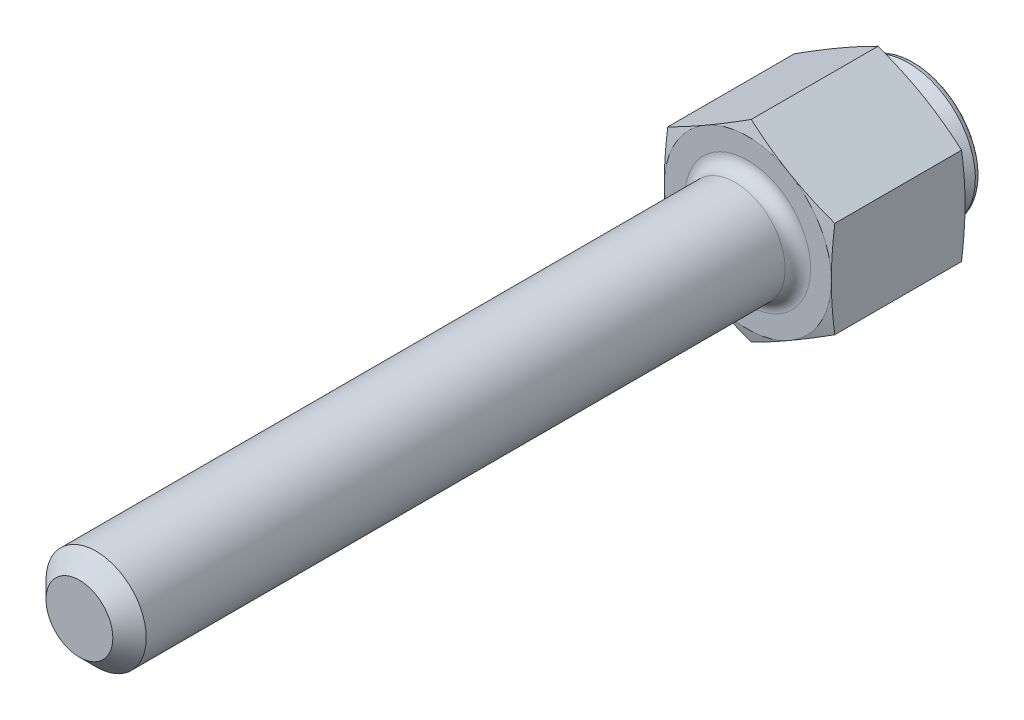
ISO-10303-21;
HEADER;
FILE_DESCRIPTION(('STEP AP214'),'2;1');
FILE_NAME('part.step','',(''),(''),'','','');
FILE_SCHEMA(('AUTOMOTIVE_DESIGN { 1 0 10303 214 1 1 1 1 }'));
ENDSEC;
DATA;
#1=APPLICATION_CONTEXT('core data for automotive mechanical design processes');
#2=APPLICATION_PROTOCOL_DEFINITION('international standard','automotive_design',2000,#1);
#3=PRODUCT_CONTEXT('',#1,'mechanical');
#4=PRODUCT('Part','Part','',(#3));
#5=PRODUCT_RELATED_PRODUCT_CATEGORY('part','',(#4));
#6=PRODUCT_DEFINITION_FORMATION('','',#4);
#7=PRODUCT_DEFINITION_CONTEXT('part definition',#1,'design');
#8=PRODUCT_DEFINITION('design','',#6,#7);
#9=PRODUCT_DEFINITION_SHAPE('','',#8);
#10=(LENGTH_UNIT() NAMED_UNIT(*) SI_UNIT(.MILLI.,.METRE.));
#11=(NAMED_UNIT(*) PLANE_ANGLE_UNIT() SI_UNIT($,.RADIAN.));
#12=(NAMED_UNIT(*) SI_UNIT($,.STERADIAN.) SOLID_ANGLE_UNIT());
#13=UNCERTAINTY_MEASURE_WITH_UNIT(LENGTH_MEASURE(1.E-05),#10,'distance_accuracy_value','');
#14=(GEOMETRIC_REPRESENTATION_CONTEXT(3) GLOBAL_UNCERTAINTY_ASSIGNED_CONTEXT((#13)) GLOBAL_UNIT_ASSIGNED_CONTEXT((#10,
#11,#12)) REPRESENTATION_CONTEXT('',''));
#15=CARTESIAN_POINT('',(0.,0.,0.));
#16=DIRECTION('',(0.,0.,1.));
#17=DIRECTION('',(1.,0.,0.));
#18=AXIS2_PLACEMENT_3D('',#15,#16,#17);
#19=CARTESIAN_POINT('',(0.,0.,4.0013999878));
#20=DIRECTION('',(0.,0.,-1.));
#21=DIRECTION('',(-0.268157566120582,0.963375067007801,0.));
#22=AXIS2_PLACEMENT_3D('',#19,#20,#21);
#23=SPHERICAL_SURFACE('',#22,3.5);
#24=CARTESIAN_POINT('',(0.,0.,2.6349999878));
#25=DIRECTION('',(0.,0.,-1.));
#26=DIRECTION('',(-0.963375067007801,-0.268157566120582,0.));
#27=AXIS2_PLACEMENT_3D('',#24,#25,#26);
#28=CIRCLE('',#27,3.2222586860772);
#29=CARTESIAN_POINT('',(-0.864073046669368,3.1042436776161,2.6349999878));
#30=VERTEX_POINT('',#29);
#31=EDGE_CURVE('E9',#30,#30,#28,.F.);
#32=CARTESIAN_POINT('',(0.,0.,2.25615730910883));
#33=DIRECTION('',(0.,0.,1.));
#34=DIRECTION('',(-0.268157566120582,0.963375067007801,0.));
#35=AXIS2_PLACEMENT_3D('',#32,#33,#34);
#36=CIRCLE('',#35,3.0338305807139);
#37=CARTESIAN_POINT('',(-0.813544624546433,2.92271673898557,2.25615730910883));
#38=VERTEX_POINT('',#37);
#39=EDGE_CURVE('E280',#38,#38,#36,.T.);
#40=CARTESIAN_POINT('',(-0.864073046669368,3.1042436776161,2.6349999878));
#41=CARTESIAN_POINT('',(-0.863611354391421,3.10258501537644,2.63093980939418));
#42=CARTESIAN_POINT('',(-0.863147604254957,3.10091896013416,2.62688288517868));
#43=CARTESIAN_POINT('',(-0.862215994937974,3.09757208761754,2.61877560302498));
#44=CARTESIAN_POINT('',(-0.861748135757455,3.09589127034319,2.61472524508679));
#45=CARTESIAN_POINT('',(-0.860808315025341,3.09251489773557,2.60663115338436));
#46=CARTESIAN_POINT('',(-0.860336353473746,3.0908193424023,2.60258741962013));
#47=CARTESIAN_POINT('',(-0.859388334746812,3.0874135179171,2.59450663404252));
#48=CARTESIAN_POINT('',(-0.858912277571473,3.08570324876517,2.59046958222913));
#49=CARTESIAN_POINT('',(-0.857956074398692,3.08226802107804,2.58240221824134));
#50=CARTESIAN_POINT('',(-0.85747592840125,3.08054306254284,2.57837190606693));
#51=CARTESIAN_POINT('',(-0.856511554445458,3.07707848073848,2.5703180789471));
#52=CARTESIAN_POINT('',(-0.856027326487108,3.07533885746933,2.56629456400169));
#53=CARTESIAN_POINT('',(-0.855054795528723,3.07184497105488,2.55825438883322));
#54=CARTESIAN_POINT('',(-0.854566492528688,3.07009070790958,2.55423772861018));
#55=CARTESIAN_POINT('',(-0.853585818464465,3.0665675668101,2.54621132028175));
#56=CARTESIAN_POINT('',(-0.853093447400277,3.06479868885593,2.54220157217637));
#57=CARTESIAN_POINT('',(-0.852104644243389,3.06124634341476,2.53418904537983));
#58=CARTESIAN_POINT('',(-0.851608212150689,3.05946287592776,2.53018626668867));
#59=CARTESIAN_POINT('',(-0.850611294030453,3.05588137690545,2.52218773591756));
#60=CARTESIAN_POINT('',(-0.850110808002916,3.05408334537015,2.5181919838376));
#61=CARTESIAN_POINT('',(-0.84910578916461,3.05047274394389,2.51020756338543));
#62=CARTESIAN_POINT('',(-0.84860125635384,3.04866017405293,2.50621889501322));
#63=CARTESIAN_POINT('',(-0.847588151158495,3.04502052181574,2.49824869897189));
#64=CARTESIAN_POINT('',(-0.847079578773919,3.0431934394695,2.49426717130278));
#65=CARTESIAN_POINT('',(-0.846058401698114,3.03952478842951,2.48631131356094));
#66=CARTESIAN_POINT('',(-0.845545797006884,3.03768321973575,2.48233698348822));
#67=CARTESIAN_POINT('',(-0.84451656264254,3.03398562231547,2.47439557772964));
#68=CARTESIAN_POINT('',(-0.843999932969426,3.03212959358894,2.47042850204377));
#69=CARTESIAN_POINT('',(-0.842962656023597,3.02840310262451,2.46250166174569));
#70=CARTESIAN_POINT('',(-0.842442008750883,3.0265326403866,2.45854189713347));
#71=CARTESIAN_POINT('',(-0.841396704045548,3.02277730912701,2.450629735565));
#72=CARTESIAN_POINT('',(-0.840872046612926,3.02089244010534,2.44667733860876));
#73=CARTESIAN_POINT('',(-0.839818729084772,3.01710832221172,2.43877996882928));
#74=CARTESIAN_POINT('',(-0.839290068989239,3.01520907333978,2.43483499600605));
#75=CARTESIAN_POINT('',(-0.838228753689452,3.01139622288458,2.42695253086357));
#76=CARTESIAN_POINT('',(-0.837696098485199,3.00948262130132,2.42301503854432));
#77=CARTESIAN_POINT('',(-0.836626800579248,3.00564109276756,2.41514759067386));
#78=CARTESIAN_POINT('',(-0.836090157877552,3.00371316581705,2.41121763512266));
#79=CARTESIAN_POINT('',(-0.835012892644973,2.99984301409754,2.40336531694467));
#80=CARTESIAN_POINT('',(-0.83447227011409,2.99790078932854,2.39944295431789));
#81=CARTESIAN_POINT('',(-0.833387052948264,2.9940020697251,2.39160587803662));
#82=CARTESIAN_POINT('',(-0.832842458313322,2.99204557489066,2.38769116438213));
#83=CARTESIAN_POINT('',(-0.83174930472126,2.98811834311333,2.37986944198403));
#84=CARTESIAN_POINT('',(-0.831200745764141,2.98614760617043,2.37596243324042));
#85=CARTESIAN_POINT('',(-0.830099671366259,2.98219191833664,2.36815617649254));
#86=CARTESIAN_POINT('',(-0.829547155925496,2.98020696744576,2.36425692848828));
#87=CARTESIAN_POINT('',(-0.828438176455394,2.97622288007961,2.3564662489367));
#88=CARTESIAN_POINT('',(-0.827881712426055,2.97422374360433,2.35257481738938));
#89=CARTESIAN_POINT('',(-0.826764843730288,2.97021131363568,2.34479982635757));
#90=CARTESIAN_POINT('',(-0.826204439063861,2.9681980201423,2.34091626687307));
#91=CARTESIAN_POINT('',(-0.825079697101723,2.96415730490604,2.33315707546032));
#92=CARTESIAN_POINT('',(-0.824515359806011,2.96212988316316,2.32928144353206));
#93=CARTESIAN_POINT('',(-0.823382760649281,2.9580609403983,2.32153816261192));
#94=CARTESIAN_POINT('',(-0.822814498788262,2.95601941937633,2.31767051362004));
#95=CARTESIAN_POINT('',(-0.82167405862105,2.95192230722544,2.30994325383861));
#96=CARTESIAN_POINT('',(-0.821101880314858,2.94986671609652,2.30608364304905));
#97=CARTESIAN_POINT('',(-0.819953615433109,2.94574149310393,2.29837251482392));
#98=CARTESIAN_POINT('',(-0.819377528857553,2.94367186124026,2.29452099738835));
#99=CARTESIAN_POINT('',(-0.818221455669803,2.9395185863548,2.28682611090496));
#100=CARTESIAN_POINT('',(-0.817641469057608,2.93743494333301,2.28298274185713));
#101=CARTESIAN_POINT('',(-0.81647760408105,2.93325367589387,2.27530420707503));
#102=CARTESIAN_POINT('',(-0.815893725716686,2.93115605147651,2.27146904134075));
#103=CARTESIAN_POINT('',(-0.814722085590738,2.92694685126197,2.26380696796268));
#104=CARTESIAN_POINT('',(-0.814134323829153,2.92483527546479,2.25998006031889));
#105=CARTESIAN_POINT('',(-0.813544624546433,2.92271673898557,2.25615730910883));
#106=B_SPLINE_CURVE_WITH_KNOTS('',3,(#40,#41,#42,#43,#44,#45,#46,#47,#48,#49,#50,#51,#52,#53,
#54,#55,#56,#57,#58,#59,#60,#61,#62,#63,#64,#65,#66,#67,#68,#69,#70,#71,#72,#73,#74,#75,#76,#77,
#78,#79,#80,#81,#82,#83,#84,#85,#86,#87,#88,#89,#90,#91,#92,#93,#94,#95,#96,#97,#98,#99,#100,
#101,#102,#103,#104,#105),.UNSPECIFIED.,.F.,.F.,(4,2,2,2,2,2,2,2,2,2,2,2,2,2,2,2,2,2,2,2,2,2,2,
2,2,2,2,2,2,2,2,2,4),(0.,0.0132304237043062,0.0264608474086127,0.0396912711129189,
0.0529216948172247,0.0661521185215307,0.0793825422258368,0.0926129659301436,0.10584338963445,
0.119073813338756,0.132304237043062,0.145534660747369,0.158765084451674,0.17199550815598,
0.185225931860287,0.198456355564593,0.211686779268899,0.224917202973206,0.238147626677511,
0.251378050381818,0.264608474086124,0.27783889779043,0.291069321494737,0.304299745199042,
0.317530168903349,0.330760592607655,0.343991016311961,0.357221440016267,0.370451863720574,
0.38368228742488,0.396912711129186,0.410143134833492,0.423373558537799),.UNSPECIFIED.);
#107=EDGE_CURVE('BSEAM14',#30,#38,#106,.T.);
#108=ORIENTED_EDGE('',*,*,#31,.F.);
#109=ORIENTED_EDGE('',*,*,#39,.T.);
#110=ORIENTED_EDGE('',*,*,#107,.T.);
#111=ORIENTED_EDGE('',*,*,#107,.F.);
#112=EDGE_LOOP('',(#108,#110,#109,#111));
#113=FACE_BOUND('',#112,.T.);
#114=ADVANCED_FACE('F14',(#113),#23,.T.);
#115=CARTESIAN_POINT('',(0.,0.,0.));
#116=DIRECTION('',(0.,0.,-1.));
#117=DIRECTION('',(0.268157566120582,-0.963375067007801,0.));
#118=AXIS2_PLACEMENT_3D('',#115,#116,#117);
#119=CYLINDRICAL_SURFACE('',#118,3.);
#120=CARTESIAN_POINT('',(0.,0.,2.12950255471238));
#121=DIRECTION('',(0.,0.,1.));
#122=DIRECTION('',(-0.268157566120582,0.963375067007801,0.));
#123=AXIS2_PLACEMENT_3D('',#120,#121,#122);
#124=CIRCLE('',#123,3.);
#125=CARTESIAN_POINT('',(-0.804472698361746,2.8901252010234,2.12950255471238));
#126=VERTEX_POINT('',#125);
#127=EDGE_CURVE('E278',#126,#126,#124,.F.);
#128=ORIENTED_EDGE('',*,*,#127,.T.);
#129=EDGE_LOOP('',(#128));
#130=FACE_BOUND('',#129,.T.);
#131=CARTESIAN_POINT('',(0.,0.,1.48621024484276));
#132=DIRECTION('',(0.,0.,-1.));
#133=DIRECTION('',(0.268157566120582,-0.963375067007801,0.));
#134=AXIS2_PLACEMENT_3D('',#131,#132,#133);
#135=CIRCLE('',#134,3.);
#136=CARTESIAN_POINT('',(0.804472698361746,-2.8901252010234,1.48621024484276));
#137=VERTEX_POINT('',#136);
#138=EDGE_CURVE('E275',#137,#137,#135,.F.);
#139=ORIENTED_EDGE('',*,*,#138,.T.);
#140=EDGE_LOOP('',(#139));
#141=FACE_BOUND('',#140,.T.);
#142=ADVANCED_FACE('F299',(#130,#141),#119,.T.);
#143=CARTESIAN_POINT('',(0.,0.,1.381));
#144=DIRECTION('',(0.,0.,-1.));
#145=DIRECTION('',(0.268157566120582,-0.963375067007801,0.));
#146=AXIS2_PLACEMENT_3D('',#143,#144,#145);
#147=CONICAL_SURFACE('',#146,3.,0.78539816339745);
#148=CARTESIAN_POINT('',(0.,0.,1.30660512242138));
#149=DIRECTION('',(0.,0.,-1.));
#150=DIRECTION('',(0.268157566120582,-0.963375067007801,0.));
#151=AXIS2_PLACEMENT_3D('',#148,#149,#150);
#152=CIRCLE('',#151,3.07439487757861);
#153=CARTESIAN_POINT('',(0.824422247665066,-2.96179537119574,1.30660512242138));
#154=VERTEX_POINT('',#153);
#155=EDGE_CURVE('E18',#154,#154,#152,.T.);
#156=ORIENTED_EDGE('',*,*,#155,.T.);
#157=EDGE_LOOP('',(#156));
#158=FACE_BOUND('',#157,.T.);
#159=CARTESIAN_POINT('',(0.,0.,0.381));
#160=DIRECTION('',(0.,0.,-1.));
#161=DIRECTION('',(0.268157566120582,-0.963375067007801,0.));
#162=AXIS2_PLACEMENT_3D('',#159,#160,#161);
#163=CIRCLE('',#162,4.);
#164=CARTESIAN_POINT('',(1.07263026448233,-3.8535002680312,0.381));
#165=VERTEX_POINT('',#164);
#166=EDGE_CURVE('E269',#165,#165,#163,.T.);
#167=ORIENTED_EDGE('',*,*,#166,.F.);
#168=EDGE_LOOP('',(#167));
#169=FACE_BOUND('',#168,.T.);
#170=ADVANCED_FACE('F305',(#158,#169),#147,.T.);
#171=CARTESIAN_POINT('',(-1.07263026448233,3.85350026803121,0.));
#172=DIRECTION('',(0.,0.,1.));
#173=DIRECTION('',(-0.268157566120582,0.963375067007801,0.));
#174=AXIS2_PLACEMENT_3D('',#171,#172,#173);
#175=PLANE('',#174);
#176=CARTESIAN_POINT('',(0.,0.,0.));
#177=DIRECTION('',(0.,0.,1.));
#178=DIRECTION('',(-0.268157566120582,0.963375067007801,0.));
#179=AXIS2_PLACEMENT_3D('',#176,#177,#178);
#180=CIRCLE('',#179,3.619);
#181=CARTESIAN_POINT('',(-0.970462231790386,3.48645436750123,0.));
#182=VERTEX_POINT('',#181);
#183=EDGE_CURVE('E272',#182,#182,#180,.F.);
#184=ORIENTED_EDGE('',*,*,#183,.T.);
#185=EDGE_LOOP('',(#184));
#186=FACE_BOUND('',#185,.T.);
#187=ADVANCED_FACE('F347',(#186),#175,.F.);
#188=CARTESIAN_POINT('',(0.,0.,0.381));
#189=DIRECTION('',(0.,0.,1.));
#190=DIRECTION('',(-0.268157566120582,0.963375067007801,0.));
#191=AXIS2_PLACEMENT_3D('',#188,#189,#190);
#192=TOROIDAL_SURFACE('',#191,3.619,0.381);
#193=ORIENTED_EDGE('',*,*,#166,.T.);
#194=EDGE_LOOP('',(#193));
#195=FACE_BOUND('',#194,.T.);
#196=ORIENTED_EDGE('',*,*,#183,.F.);
#197=EDGE_LOOP('',(#196));
#198=FACE_BOUND('',#197,.T.);
#199=ADVANCED_FACE('F350',(#195,#198),#192,.T.);
#200=CARTESIAN_POINT('',(0.,0.,2.12950255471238));
#201=DIRECTION('',(0.,0.,1.));
#202=DIRECTION('',(-0.268157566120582,0.963375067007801,0.));
#203=AXIS2_PLACEMENT_3D('',#200,#201,#202);
#204=TOROIDAL_SURFACE('',#203,3.254,0.254);
#205=ORIENTED_EDGE('',*,*,#39,.F.);
#206=EDGE_LOOP('',(#205));
#207=FACE_BOUND('',#206,.T.);
#208=ORIENTED_EDGE('',*,*,#127,.F.);
#209=EDGE_LOOP('',(#208));
#210=FACE_BOUND('',#209,.T.);
#211=ADVANCED_FACE('F321',(#207,#210),#204,.F.);
#212=CARTESIAN_POINT('',(0.,0.,1.48621024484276));
#213=DIRECTION('',(0.,0.,-1.));
#214=DIRECTION('',(0.268157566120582,-0.963375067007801,0.));
#215=AXIS2_PLACEMENT_3D('',#212,#213,#214);
#216=TOROIDAL_SURFACE('',#215,3.254,0.254);
#217=ORIENTED_EDGE('',*,*,#138,.F.);
#218=EDGE_LOOP('',(#217));
#219=FACE_BOUND('',#218,.T.);
#220=ORIENTED_EDGE('',*,*,#155,.F.);
#221=EDGE_LOOP('',(#220));
#222=FACE_BOUND('',#221,.T.);
#223=ADVANCED_FACE('F16',(#219,#222),#216,.F.);
#224=CARTESIAN_POINT('',(0.,0.,49.9999999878));
#225=DIRECTION('',(0.,0.,1.));
#226=DIRECTION('',(1.,0.,0.));
#227=AXIS2_PLACEMENT_3D('',#224,#225,#226);
#228=PLANE('',#227);
#229=CARTESIAN_POINT('',(0.,0.,49.9999999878));
#230=DIRECTION('',(0.,0.,1.));
#231=DIRECTION('',(1.,0.,0.));
#232=AXIS2_PLACEMENT_3D('',#229,#230,#231);
#233=CIRCLE('',#232,2.);
#234=CARTESIAN_POINT('',(2.,0.,49.9999999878));
#235=VERTEX_POINT('',#234);
#236=EDGE_CURVE('E264',#235,#235,#233,.T.);
#237=ORIENTED_EDGE('',*,*,#236,.T.);
#238=EDGE_LOOP('',(#237));
#239=FACE_BOUND('',#238,.T.);
#240=ADVANCED_FACE('F309',(#239),#228,.T.);
#241=CARTESIAN_POINT('',(0.,0.,49.9999999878));
#242=DIRECTION('',(0.,0.,-1.));
#243=DIRECTION('',(-1.,0.,0.));
#244=AXIS2_PLACEMENT_3D('',#241,#242,#243);
#245=CONICAL_SURFACE('',#244,2.,0.785398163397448);
#246=CARTESIAN_POINT('',(0.,0.,48.9999999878));
#247=DIRECTION('',(0.,0.,1.));
#248=DIRECTION('',(1.,0.,0.));
#249=AXIS2_PLACEMENT_3D('',#246,#247,#248);
#250=CIRCLE('',#249,3.);
#251=CARTESIAN_POINT('',(3.,0.,48.9999999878));
#252=VERTEX_POINT('',#251);
#253=EDGE_CURVE('E23',#252,#252,#250,.F.);
#254=ORIENTED_EDGE('',*,*,#253,.F.);
#255=EDGE_LOOP('',(#254));
#256=FACE_BOUND('',#255,.T.);
#257=ORIENTED_EDGE('',*,*,#236,.F.);
#258=EDGE_LOOP('',(#257));
#259=FACE_BOUND('',#258,.T.);
#260=ADVANCED_FACE('F311',(#256,#259),#245,.T.);
#261=CARTESIAN_POINT('',(0.,0.,49.9999999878));
#262=DIRECTION('',(0.,0.,-1.));
#263=DIRECTION('',(-1.,0.,0.));
#264=AXIS2_PLACEMENT_3D('',#261,#262,#263);
#265=CYLINDRICAL_SURFACE('',#264,3.);
#266=ORIENTED_EDGE('',*,*,#253,.T.);
#267=EDGE_LOOP('',(#266));
#268=FACE_BOUND('',#267,.T.);
#269=CARTESIAN_POINT('',(0.,0.,10.7619999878));
#270=DIRECTION('',(0.,0.,-1.));
#271=DIRECTION('',(-1.,0.,0.));
#272=AXIS2_PLACEMENT_3D('',#269,#270,#271);
#273=CIRCLE('',#272,3.);
#274=CARTESIAN_POINT('',(-3.,0.,10.7619999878));
#275=VERTEX_POINT('',#274);
#276=EDGE_CURVE('E258',#275,#275,#273,.F.);
#277=ORIENTED_EDGE('',*,*,#276,.T.);
#278=EDGE_LOOP('',(#277));
#279=FACE_BOUND('',#278,.T.);
#280=ADVANCED_FACE('F318',(#268,#279),#265,.T.);
#281=CARTESIAN_POINT('',(0.,0.,10.7619999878));
#282=DIRECTION('',(0.,0.,-1.));
#283=DIRECTION('',(-1.,0.,0.));
#284=AXIS2_PLACEMENT_3D('',#281,#282,#283);
#285=TOROIDAL_SURFACE('',#284,3.762,0.762);
#286=CARTESIAN_POINT('',(0.,0.,9.9999999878));
#287=DIRECTION('',(0.,0.,-1.));
#288=DIRECTION('',(-1.,0.,0.));
#289=AXIS2_PLACEMENT_3D('',#286,#287,#288);
#290=CIRCLE('',#289,3.762);
#291=CARTESIAN_POINT('',(-3.762,0.,9.9999999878));
#292=VERTEX_POINT('',#291);
#293=EDGE_CURVE('E261',#292,#292,#290,.T.);
#294=ORIENTED_EDGE('',*,*,#293,.F.);
#295=EDGE_LOOP('',(#294));
#296=FACE_BOUND('',#295,.T.);
#297=ORIENTED_EDGE('',*,*,#276,.F.);
#298=EDGE_LOOP('',(#297));
#299=FACE_BOUND('',#298,.T.);
#300=ADVANCED_FACE('F324',(#296,#299),#285,.F.);
#301=CARTESIAN_POINT('',(-5.,8.66025403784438,9.9999999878));
#302=DIRECTION('',(0.,0.,-1.));
#303=DIRECTION('',(-1.,0.,0.));
#304=AXIS2_PLACEMENT_3D('',#301,#302,#303);
#305=PLANE('',#304);
#306=CARTESIAN_POINT('',(0.,0.,9.9999999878));
#307=DIRECTION('',(0.,0.,-1.));
#308=DIRECTION('',(-1.,0.,0.));
#309=AXIS2_PLACEMENT_3D('',#306,#307,#308);
#310=CIRCLE('',#309,5.);
#311=CARTESIAN_POINT('',(-5.,0.,9.9999999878));
#312=VERTEX_POINT('',#311);
#313=CARTESIAN_POINT('',(-2.5,4.33012701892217,9.9999999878));
#314=VERTEX_POINT('',#313);
#315=EDGE_CURVE('E624',#312,#314,#310,.T.);
#316=ORIENTED_EDGE('',*,*,#315,.F.);
#317=CARTESIAN_POINT('',(0.,0.,9.9999999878));
#318=DIRECTION('',(0.,0.,-1.));
#319=DIRECTION('',(-1.,0.,0.));
#320=AXIS2_PLACEMENT_3D('',#317,#318,#319);
#321=CIRCLE('',#320,5.);
#322=CARTESIAN_POINT('',(-2.5,-4.33012701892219,9.9999999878));
#323=VERTEX_POINT('',#322);
#324=EDGE_CURVE('E235',#323,#312,#321,.T.);
#325=ORIENTED_EDGE('',*,*,#324,.F.);
#326=CARTESIAN_POINT('',(2.5,-4.33012701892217,9.9999999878));
#327=VERTEX_POINT('',#326);
#328=EDGE_CURVE('E249',#327,#323,#321,.T.);
#329=ORIENTED_EDGE('',*,*,#328,.F.);
#330=CARTESIAN_POINT('',(5.,0.,9.9999999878));
#331=VERTEX_POINT('',#330);
#332=EDGE_CURVE('E670',#331,#327,#321,.T.);
#333=ORIENTED_EDGE('',*,*,#332,.F.);
#334=CARTESIAN_POINT('',(2.5,4.33012701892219,9.9999999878));
#335=VERTEX_POINT('',#334);
#336=EDGE_CURVE('E672',#335,#331,#321,.T.);
#337=ORIENTED_EDGE('',*,*,#336,.F.);
#338=EDGE_CURVE('E250',#314,#335,#321,.T.);
#339=ORIENTED_EDGE('',*,*,#338,.F.);
#340=EDGE_LOOP('',(#316,#325,#329,#333,#337,#339));
#341=FACE_BOUND('',#340,.T.);
#342=ORIENTED_EDGE('',*,*,#293,.T.);
#343=EDGE_LOOP('',(#342));
#344=FACE_BOUND('',#343,.T.);
#345=ADVANCED_FACE('F329',(#341,#344),#305,.F.);
#346=CARTESIAN_POINT('',(0.,0.,8.58583630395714));
#347=DIRECTION('',(0.,0.,-1.));
#348=DIRECTION('',(-1.,0.,0.));
#349=AXIS2_PLACEMENT_3D('',#346,#347,#348);
#350=CONICAL_SURFACE('',#349,10.2777307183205,1.30899693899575);
#351=CARTESIAN_POINT('',(5.,-7.71939307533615,8.87535574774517));
#352=CARTESIAN_POINT('',(5.00000000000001,-7.49157817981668,8.92657651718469));
#353=CARTESIAN_POINT('',(5.00000000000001,-7.26362305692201,8.97718453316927));
#354=CARTESIAN_POINT('',(5.00000000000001,-6.80736329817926,9.07684412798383));
#355=CARTESIAN_POINT('',(5.00000000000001,-6.57905864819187,9.1258956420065));
#356=CARTESIAN_POINT('',(5.00000000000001,-6.12183892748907,9.222151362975));
#357=CARTESIAN_POINT('',(5.00000000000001,-5.89292348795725,9.26935382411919));
#358=CARTESIAN_POINT('',(5.00000000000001,-5.43462208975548,9.36141523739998));
#359=CARTESIAN_POINT('',(5.00000000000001,-5.20523613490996,9.40627420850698));
#360=CARTESIAN_POINT('',(5.00000000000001,-4.74777405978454,9.49273650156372));
#361=CARTESIAN_POINT('',(5.00000000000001,-4.51970239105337,9.53436326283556));
#362=CARTESIAN_POINT('',(5.00000000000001,-4.06294165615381,9.61407288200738));
#363=CARTESIAN_POINT('',(5.00000000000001,-3.83425260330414,9.65215581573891));
#364=CARTESIAN_POINT('',(5.00000000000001,-3.37620199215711,9.72393812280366));
#365=CARTESIAN_POINT('',(5.00000000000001,-3.14684049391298,9.75763787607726));
#366=CARTESIAN_POINT('',(5.00000000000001,-2.68738519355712,9.81967591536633));
#367=CARTESIAN_POINT('',(5.,-2.4572913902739,9.84801419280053));
#368=CARTESIAN_POINT('',(5.,-1.99373595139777,9.89854595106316));
#369=CARTESIAN_POINT('',(5.,-1.76026606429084,9.92066484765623));
#370=CARTESIAN_POINT('',(5.00000000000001,-1.29272172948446,9.95724257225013));
#371=CARTESIAN_POINT('',(5.00000000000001,-1.05864729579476,9.9717015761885));
#372=CARTESIAN_POINT('',(5.,-0.590237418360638,9.99211738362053));
#373=CARTESIAN_POINT('',(5.,-0.355902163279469,9.99807842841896));
#374=CARTESIAN_POINT('',(5.,0.112826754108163,10.0011300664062));
#375=CARTESIAN_POINT('',(5.,0.347220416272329,9.99822068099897));
#376=CARTESIAN_POINT('',(5.,0.816634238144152,9.98369271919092));
#377=CARTESIAN_POINT('',(5.,1.05165334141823,9.97204069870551));
#378=CARTESIAN_POINT('',(5.,1.52115001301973,9.94069812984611));
#379=CARTESIAN_POINT('',(5.,1.7556275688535,9.92100739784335));
#380=CARTESIAN_POINT('',(5.,2.22403930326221,9.87460237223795));
#381=CARTESIAN_POINT('',(5.,2.45797299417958,9.84788323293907));
#382=CARTESIAN_POINT('',(5.,2.92508386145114,9.78855862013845));
#383=CARTESIAN_POINT('',(5.,3.15826103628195,9.75595313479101));
#384=CARTESIAN_POINT('',(5.,3.6242567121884,9.68586811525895));
#385=CARTESIAN_POINT('',(5.,3.85707404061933,9.64838085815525));
#386=CARTESIAN_POINT('',(5.,4.32204975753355,9.56950129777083));
#387=CARTESIAN_POINT('',(5.,4.55420812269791,9.5281088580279));
#388=CARTESIAN_POINT('',(5.,5.01796734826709,9.44218275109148));
#389=CARTESIAN_POINT('',(5.,5.24956814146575,9.39764872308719));
#390=CARTESIAN_POINT('',(5.,5.71227051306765,9.30605222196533));
#391=CARTESIAN_POINT('',(5.,5.94337208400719,9.2589897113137));
#392=CARTESIAN_POINT('',(4.99999999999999,6.63618971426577,9.11473521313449));
#393=CARTESIAN_POINT('',(4.99999999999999,7.09727206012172,9.01450411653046));
#394=CARTESIAN_POINT('',(4.99999999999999,8.01819214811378,8.80869227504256));
#395=CARTESIAN_POINT('',(4.99999999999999,8.47802997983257,8.703111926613));
#396=CARTESIAN_POINT('',(4.99999999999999,9.39186405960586,8.48941702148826));
#397=CARTESIAN_POINT('',(4.99999999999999,9.84586964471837,8.38134228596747));
#398=CARTESIAN_POINT('',(4.99999999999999,10.7532680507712,8.16261349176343));
#399=CARTESIAN_POINT('',(4.99999999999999,11.2066608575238,8.05195937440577));
#400=CARTESIAN_POINT('',(4.99999999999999,12.112331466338,7.82893014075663));
#401=CARTESIAN_POINT('',(4.99999999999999,12.5646099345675,7.71655772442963));
#402=CARTESIAN_POINT('',(4.99999999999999,13.4687908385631,7.49037953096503));
#403=CARTESIAN_POINT('',(4.99999999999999,13.9206932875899,7.37657380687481));
#404=CARTESIAN_POINT('',(5.,14.3724678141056,7.26226851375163));
#405=B_SPLINE_CURVE_WITH_KNOTS('',3,(#351,#352,#353,#354,#355,#356,#357,#358,#359,#360,#361,
#362,#363,#364,#365,#366,#367,#368,#369,#370,#371,#372,#373,#374,#375,#376,#377,#378,#379,#380,
#381,#382,#383,#384,#385,#386,#387,#388,#389,#390,#391,#392,#393,#394,#395,#396,#397,#398,#399,
#400,#401,#402,#403,#404),.UNSPECIFIED.,.F.,.F.,(4,2,2,2,2,2,2,2,2,2,2,2,2,2,2,2,2,2,2,2,2,2,2,
2,2,2,4),(0.,0.700508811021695,1.40104675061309,2.10223090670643,2.80340938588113,
3.49890505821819,4.19438584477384,4.88980630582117,5.58522787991,6.28866433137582,
6.99208462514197,7.69515372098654,8.39822112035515,9.10399183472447,9.8097786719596,
10.5160533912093,11.2223295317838,11.9297368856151,12.6371689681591,13.3446824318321,
14.0522064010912,15.4677020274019,16.883092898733,18.283157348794,19.6832536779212,
21.0813391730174,22.4793730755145),.UNSPECIFIED.);
#406=CARTESIAN_POINT('',(5.,-2.88675134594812,9.79274056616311));
#407=VERTEX_POINT('',#406);
#408=EDGE_CURVE('E231',#331,#407,#405,.F.);
#409=ORIENTED_EDGE('',*,*,#408,.F.);
#410=ORIENTED_EDGE('',*,*,#332,.T.);
#411=CARTESIAN_POINT('',(5.0002,-2.88663587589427,9.79270962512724));
#412=CARTESIAN_POINT('',(4.79254599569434,-3.00652497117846,9.824847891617));
#413=CARTESIAN_POINT('',(4.58451548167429,-3.12663144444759,9.85402417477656));
#414=CARTESIAN_POINT('',(4.16771975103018,-3.36726857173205,9.90528421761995));
#415=CARTESIAN_POINT('',(3.95895427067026,-3.48779937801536,9.92736509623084));
#416=CARTESIAN_POINT('',(3.54195440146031,-3.72855436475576,9.96314521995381));
#417=CARTESIAN_POINT('',(3.33372283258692,-3.84877691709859,9.97688713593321));
#418=CARTESIAN_POINT('',(2.91699413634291,-4.08937534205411,9.99531364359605));
#419=CARTESIAN_POINT('',(2.70849706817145,-4.20975118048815,9.9999999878));
#420=CARTESIAN_POINT('',(2.29150293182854,-4.45050285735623,9.9999999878));
#421=CARTESIAN_POINT('',(2.08300586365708,-4.57087869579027,9.99531364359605));
#422=CARTESIAN_POINT('',(1.66627716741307,-4.81147712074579,9.97688713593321));
#423=CARTESIAN_POINT('',(1.45804559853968,-4.93169967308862,9.9631452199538));
#424=CARTESIAN_POINT('',(1.04104572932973,-5.17245465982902,9.92736509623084));
#425=CARTESIAN_POINT('',(0.832280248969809,-5.29298546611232,9.90528421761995));
#426=CARTESIAN_POINT('',(0.415484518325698,-5.53362259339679,9.85402417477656));
#427=CARTESIAN_POINT('',(0.207454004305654,-5.65372906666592,9.824847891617));
#428=CARTESIAN_POINT('',(-0.000200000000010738,-5.7736181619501,9.79270962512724));
#429=B_SPLINE_CURVE_WITH_KNOTS('',3,(#411,#412,#413,#414,#415,#416,#417,#418,#419,#420,#421,
#422,#423,#424,#425,#426,#427,#428),.UNSPECIFIED.,.F.,.F.,(4,2,2,2,2,2,2,2,4),(0.,
0.72580523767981,1.45190481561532,2.17425686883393,2.89646911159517,3.61868135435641,
4.34103340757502,5.06713298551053,5.79293822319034),.UNSPECIFIED.);
#430=EDGE_CURVE('E230',#407,#327,#429,.T.);
#431=ORIENTED_EDGE('',*,*,#430,.F.);
#432=EDGE_LOOP('',(#409,#410,#431));
#433=FACE_BOUND('',#432,.T.);
#434=ADVANCED_FACE('F341',(#433),#350,.T.);
#435=CARTESIAN_POINT('',(-0.000200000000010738,5.7736181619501,9.79270962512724));
#436=CARTESIAN_POINT('',(0.207454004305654,5.65372906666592,9.824847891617));
#437=CARTESIAN_POINT('',(0.415484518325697,5.53362259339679,9.85402417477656));
#438=CARTESIAN_POINT('',(0.832280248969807,5.29298546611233,9.90528421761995));
#439=CARTESIAN_POINT('',(1.04104572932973,5.17245465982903,9.92736509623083));
#440=CARTESIAN_POINT('',(1.45804559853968,4.93169967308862,9.9631452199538));
#441=CARTESIAN_POINT('',(1.66627716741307,4.81147712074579,9.97688713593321));
#442=CARTESIAN_POINT('',(2.08300586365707,4.57087869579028,9.99531364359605));
#443=CARTESIAN_POINT('',(2.29150293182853,4.45050285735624,9.9999999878));
#444=CARTESIAN_POINT('',(2.70849706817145,4.20975118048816,9.9999999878));
#445=CARTESIAN_POINT('',(2.9169941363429,4.08937534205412,9.99531364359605));
#446=CARTESIAN_POINT('',(3.33372283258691,3.8487769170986,9.97688713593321));
#447=CARTESIAN_POINT('',(3.5419544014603,3.72855436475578,9.9631452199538));
#448=CARTESIAN_POINT('',(3.95895427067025,3.48779937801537,9.92736509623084));
#449=CARTESIAN_POINT('',(4.16771975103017,3.36726857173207,9.90528421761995));
#450=CARTESIAN_POINT('',(4.58451548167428,3.12663144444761,9.85402417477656));
#451=CARTESIAN_POINT('',(4.79254599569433,3.00652497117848,9.824847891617));
#452=CARTESIAN_POINT('',(5.0002,2.88663587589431,9.79270962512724));
#453=B_SPLINE_CURVE_WITH_KNOTS('',3,(#435,#436,#437,#438,#439,#440,#441,#442,#443,#444,#445,
#446,#447,#448,#449,#450,#451,#452),.UNSPECIFIED.,.F.,.F.,(4,2,2,2,2,2,2,2,4),(0.,
0.725805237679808,1.45190481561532,2.17425686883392,2.89646911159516,3.6186813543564,
4.341033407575,5.06713298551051,5.79293822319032),.UNSPECIFIED.);
#454=CARTESIAN_POINT('',(5.,2.88675134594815,9.7927405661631));
#455=VERTEX_POINT('',#454);
#456=EDGE_CURVE('E643',#335,#455,#453,.T.);
#457=ORIENTED_EDGE('',*,*,#456,.F.);
#458=ORIENTED_EDGE('',*,*,#336,.T.);
#459=EDGE_CURVE('E217',#455,#331,#405,.F.);
#460=ORIENTED_EDGE('',*,*,#459,.F.);
#461=EDGE_LOOP('',(#457,#458,#460));
#462=FACE_BOUND('',#461,.T.);
#463=ADVANCED_FACE('F418',(#462),#350,.T.);
#464=CARTESIAN_POINT('',(-5.0002,2.88663587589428,9.79270962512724));
#465=CARTESIAN_POINT('',(-4.79254599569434,3.00652497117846,9.824847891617));
#466=CARTESIAN_POINT('',(-4.58451548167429,3.12663144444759,9.85402417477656));
#467=CARTESIAN_POINT('',(-4.16771975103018,3.36726857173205,9.90528421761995));
#468=CARTESIAN_POINT('',(-3.95895427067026,3.48779937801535,9.92736509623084));
#469=CARTESIAN_POINT('',(-3.54195440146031,3.72855436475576,9.9631452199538));
#470=CARTESIAN_POINT('',(-3.33372283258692,3.84877691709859,9.97688713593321));
#471=CARTESIAN_POINT('',(-2.91699413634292,4.08937534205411,9.99531364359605));
#472=CARTESIAN_POINT('',(-2.70849706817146,4.20975118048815,9.9999999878));
#473=CARTESIAN_POINT('',(-2.29150293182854,4.45050285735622,9.9999999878));
#474=CARTESIAN_POINT('',(-2.08300586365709,4.57087869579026,9.99531364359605));
#475=CARTESIAN_POINT('',(-1.66627716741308,4.81147712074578,9.97688713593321));
#476=CARTESIAN_POINT('',(-1.45804559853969,4.93169967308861,9.96314521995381));
#477=CARTESIAN_POINT('',(-1.04104572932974,5.17245465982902,9.92736509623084));
#478=CARTESIAN_POINT('',(-0.83228024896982,5.29298546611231,9.90528421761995));
#479=CARTESIAN_POINT('',(-0.415484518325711,5.53362259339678,9.85402417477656));
#480=CARTESIAN_POINT('',(-0.207454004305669,5.65372906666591,9.824847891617));
#481=CARTESIAN_POINT('',(0.00019999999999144,5.7736181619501,9.79270962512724));
#482=B_SPLINE_CURVE_WITH_KNOTS('',3,(#464,#465,#466,#467,#468,#469,#470,#471,#472,#473,#474,
#475,#476,#477,#478,#479,#480,#481),.UNSPECIFIED.,.F.,.F.,(4,2,2,2,2,2,2,2,4),(0.,
0.725805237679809,1.45190481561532,2.17425686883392,2.89646911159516,3.6186813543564,
4.341033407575,5.06713298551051,5.79293822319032),.UNSPECIFIED.);
#483=CARTESIAN_POINT('',(0.,5.77350269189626,9.7927405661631));
#484=VERTEX_POINT('',#483);
#485=EDGE_CURVE('E626',#314,#484,#482,.T.);
#486=ORIENTED_EDGE('',*,*,#485,.F.);
#487=ORIENTED_EDGE('',*,*,#338,.T.);
#488=EDGE_CURVE('E636',#484,#335,#453,.T.);
#489=ORIENTED_EDGE('',*,*,#488,.F.);
#490=EDGE_LOOP('',(#486,#487,#489));
#491=FACE_BOUND('',#490,.T.);
#492=ADVANCED_FACE('F159',(#491),#350,.T.);
#493=ORIENTED_EDGE('',*,*,#315,.T.);
#494=CARTESIAN_POINT('',(-5.,2.88675134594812,9.7927405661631));
#495=VERTEX_POINT('',#494);
#496=EDGE_CURVE('E629',#495,#314,#482,.T.);
#497=ORIENTED_EDGE('',*,*,#496,.F.);
#498=CARTESIAN_POINT('',(-5.,-7.71939307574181,8.87535574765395));
#499=CARTESIAN_POINT('',(-5.,-7.49157818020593,8.92657651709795));
#500=CARTESIAN_POINT('',(-4.99999999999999,-7.26362305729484,8.97718453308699));
#501=CARTESIAN_POINT('',(-4.99999999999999,-6.80736329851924,9.07684412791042));
#502=CARTESIAN_POINT('',(-4.99999999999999,-6.57905864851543,9.1258956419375));
#503=CARTESIAN_POINT('',(-5.,-6.12183892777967,9.22215136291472));
#504=CARTESIAN_POINT('',(-5.,-5.89292348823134,9.26935382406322));
#505=CARTESIAN_POINT('',(-5.,-5.4346220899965,9.36141523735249));
#506=CARTESIAN_POINT('',(-5.,-5.20523613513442,9.40627420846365));
#507=CARTESIAN_POINT('',(-5.,-4.74777405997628,9.49273650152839));
#508=CARTESIAN_POINT('',(-5.,-4.51970239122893,9.53436326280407));
#509=CARTESIAN_POINT('',(-5.,-4.06294165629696,9.61407288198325));
#510=CARTESIAN_POINT('',(-5.,-3.83425260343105,9.6521558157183));
#511=CARTESIAN_POINT('',(-5.,-3.37620199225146,9.7239381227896));
#512=CARTESIAN_POINT('',(-5.,-3.146840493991,9.75763787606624));
#513=CARTESIAN_POINT('',(-5.,-2.68738519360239,9.81967591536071));
#514=CARTESIAN_POINT('',(-5.,-2.45729139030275,9.84801419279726));
#515=CARTESIAN_POINT('',(-5.,-1.9937359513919,9.89854595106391));
#516=CARTESIAN_POINT('',(-5.,-1.76026606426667,9.92066484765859));
#517=CARTESIAN_POINT('',(-5.,-1.29272172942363,9.95724257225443));
#518=CARTESIAN_POINT('',(-5.,-1.05864729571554,9.97170157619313));
#519=CARTESIAN_POINT('',(-5.,-0.59023741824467,9.99211738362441));
#520=CARTESIAN_POINT('',(-5.,-0.355902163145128,9.99807842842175));
#521=CARTESIAN_POINT('',(-5.,0.112826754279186,10.0011300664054));
#522=CARTESIAN_POINT('',(-5.,0.347220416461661,9.99822068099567));
#523=CARTESIAN_POINT('',(-5.,0.816634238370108,9.98369271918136));
#524=CARTESIAN_POINT('',(-5.00000000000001,1.0516533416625,9.9720406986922));
#525=CARTESIAN_POINT('',(-5.00000000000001,1.52115001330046,9.94069812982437));
#526=CARTESIAN_POINT('',(-5.00000000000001,1.75562756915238,9.92100739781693));
#527=CARTESIAN_POINT('',(-5.00000000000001,2.22403930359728,9.87460237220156));
#528=CARTESIAN_POINT('',(-5.00000000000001,2.45797299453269,9.84788323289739));
#529=CARTESIAN_POINT('',(-5.00000000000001,2.9250838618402,9.78855862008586));
#530=CARTESIAN_POINT('',(-5.,3.15826103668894,9.75595313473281));
#531=CARTESIAN_POINT('',(-5.,3.62425671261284,9.6858681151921));
#532=CARTESIAN_POINT('',(-5.00000000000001,3.85707404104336,9.64838085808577));
#533=CARTESIAN_POINT('',(-5.00000000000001,4.32204975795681,9.56950129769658));
#534=CARTESIAN_POINT('',(-5.00000000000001,4.5542081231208,9.52810885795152));
#535=CARTESIAN_POINT('',(-5.00000000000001,5.0179673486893,9.44218275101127));
#536=CARTESIAN_POINT('',(-5.00000000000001,5.24956814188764,9.39764872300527));
#537=CARTESIAN_POINT('',(-5.00000000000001,5.71227051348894,9.30605222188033));
#538=CARTESIAN_POINT('',(-5.00000000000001,5.94337208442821,9.25898971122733));
#539=CARTESIAN_POINT('',(-5.00000000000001,6.63618971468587,9.11473521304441));
#540=CARTESIAN_POINT('',(-5.00000000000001,7.09727206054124,9.01450411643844));
#541=CARTESIAN_POINT('',(-5.00000000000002,8.01819214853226,8.8086922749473));
#542=CARTESIAN_POINT('',(-5.00000000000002,8.47802998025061,8.70311192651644));
#543=CARTESIAN_POINT('',(-5.00000000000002,9.39186406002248,8.48941702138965));
#544=CARTESIAN_POINT('',(-5.00000000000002,9.84586964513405,8.38134228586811));
#545=CARTESIAN_POINT('',(-5.00000000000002,10.7532680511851,8.16261349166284));
#546=CARTESIAN_POINT('',(-5.00000000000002,11.2066608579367,8.0519593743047));
#547=CARTESIAN_POINT('',(-5.00000000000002,12.1123314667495,7.82893014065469));
#548=CARTESIAN_POINT('',(-5.00000000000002,12.5646099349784,7.71655772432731));
#549=CARTESIAN_POINT('',(-5.00000000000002,13.4687908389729,7.49037953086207));
#550=CARTESIAN_POINT('',(-5.00000000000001,13.9206932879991,7.37657380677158));
#551=CARTESIAN_POINT('',(-5.,14.3724678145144,7.26226851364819));
#552=B_SPLINE_CURVE_WITH_KNOTS('',3,(#498,#499,#500,#501,#502,#503,#504,#505,#506,#507,#508,
#509,#510,#511,#512,#513,#514,#515,#516,#517,#518,#519,#520,#521,#522,#523,#524,#525,#526,#527,
#528,#529,#530,#531,#532,#533,#534,#535,#536,#537,#538,#539,#540,#541,#542,#543,#544,#545,#546,
#547,#548,#549,#550,#551),.UNSPECIFIED.,.F.,.F.,(4,2,2,2,2,2,2,2,2,2,2,2,2,2,2,2,2,2,2,2,2,2,2,
2,2,2,4),(0.,0.700508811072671,1.40104675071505,2.10223090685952,2.80340938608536,
3.49890505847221,4.19438584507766,4.88980630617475,5.58522788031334,6.28866433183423,
6.99208462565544,7.69515372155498,8.39822112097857,9.1039918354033,9.80977867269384,
10.5160533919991,11.2223295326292,11.9297368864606,12.6371689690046,13.3446824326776,
14.0522064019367,15.467702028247,16.8830928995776,18.2831573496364,19.6832536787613,
21.0813391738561,22.4793730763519),.UNSPECIFIED.);
#553=EDGE_CURVE('E642',#312,#495,#552,.T.);
#554=ORIENTED_EDGE('',*,*,#553,.F.);
#555=EDGE_LOOP('',(#493,#497,#554));
#556=FACE_BOUND('',#555,.T.);
#557=ADVANCED_FACE('F429',(#556),#350,.T.);
#558=ORIENTED_EDGE('',*,*,#324,.T.);
#559=CARTESIAN_POINT('',(-5.,-2.88675134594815,9.7927405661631));
#560=VERTEX_POINT('',#559);
#561=EDGE_CURVE('E653',#560,#312,#552,.T.);
#562=ORIENTED_EDGE('',*,*,#561,.F.);
#563=CARTESIAN_POINT('',(0.000199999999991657,-5.7736181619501,9.79270962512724));
#564=CARTESIAN_POINT('',(-0.207454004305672,-5.65372906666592,9.824847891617));
#565=CARTESIAN_POINT('',(-0.415484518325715,-5.53362259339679,9.85402417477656));
#566=CARTESIAN_POINT('',(-0.832280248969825,-5.29298546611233,9.90528421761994));
#567=CARTESIAN_POINT('',(-1.04104572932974,-5.17245465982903,9.92736509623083));
#568=CARTESIAN_POINT('',(-1.4580455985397,-4.93169967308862,9.9631452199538));
#569=CARTESIAN_POINT('',(-1.66627716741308,-4.8114771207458,9.97688713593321));
#570=CARTESIAN_POINT('',(-2.08300586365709,-4.57087869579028,9.99531364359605));
#571=CARTESIAN_POINT('',(-2.29150293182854,-4.45050285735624,9.9999999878));
#572=CARTESIAN_POINT('',(-2.70849706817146,-4.20975118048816,9.9999999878));
#573=CARTESIAN_POINT('',(-2.91699413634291,-4.08937534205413,9.99531364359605));
#574=CARTESIAN_POINT('',(-3.33372283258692,-3.84877691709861,9.97688713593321));
#575=CARTESIAN_POINT('',(-3.54195440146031,-3.72855436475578,9.9631452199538));
#576=CARTESIAN_POINT('',(-3.95895427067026,-3.48779937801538,9.92736509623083));
#577=CARTESIAN_POINT('',(-4.16771975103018,-3.36726857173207,9.90528421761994));
#578=CARTESIAN_POINT('',(-4.58451548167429,-3.12663144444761,9.85402417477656));
#579=CARTESIAN_POINT('',(-4.79254599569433,-3.00652497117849,9.82484789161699));
#580=CARTESIAN_POINT('',(-5.0002,-2.88663587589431,9.79270962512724));
#581=B_SPLINE_CURVE_WITH_KNOTS('',3,(#563,#564,#565,#566,#567,#568,#569,#570,#571,#572,#573,
#574,#575,#576,#577,#578,#579,#580),.UNSPECIFIED.,.F.,.F.,(4,2,2,2,2,2,2,2,4),(0.,
0.725805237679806,1.45190481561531,2.17425686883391,2.89646911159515,3.61868135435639,
4.34103340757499,5.0671329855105,5.7929382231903),.UNSPECIFIED.);
#582=EDGE_CURVE('E208',#323,#560,#581,.T.);
#583=ORIENTED_EDGE('',*,*,#582,.F.);
#584=EDGE_LOOP('',(#558,#562,#583));
#585=FACE_BOUND('',#584,.T.);
#586=ADVANCED_FACE('F430',(#585),#350,.T.);
#587=ORIENTED_EDGE('',*,*,#328,.T.);
#588=CARTESIAN_POINT('',(0.,-5.77350269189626,9.7927405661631));
#589=VERTEX_POINT('',#588);
#590=EDGE_CURVE('E216',#589,#323,#581,.T.);
#591=ORIENTED_EDGE('',*,*,#590,.F.);
#592=EDGE_CURVE('E223',#327,#589,#429,.T.);
#593=ORIENTED_EDGE('',*,*,#592,.F.);
#594=EDGE_LOOP('',(#587,#591,#593));
#595=FACE_BOUND('',#594,.T.);
#596=ADVANCED_FACE('F420',(#595),#350,.T.);
#597=CARTESIAN_POINT('',(5.,-2.88675134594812,9.9999999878));
#598=DIRECTION('',(0.5,-0.866025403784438,0.));
#599=DIRECTION('',(-0.866025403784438,-0.5,0.));
#600=AXIS2_PLACEMENT_3D('',#597,#598,#599);
#601=PLANE('',#600);
#602=DIRECTION('',(0.,0.,-1.));
#603=VECTOR('',#602,1.);
#604=CARTESIAN_POINT('',(0.,-5.77350269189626,9.9999999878));
#605=LINE('',#604,#603);
#606=CARTESIAN_POINT('',(0.,-5.77350269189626,2.2072594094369));
#607=VERTEX_POINT('',#606);
#608=EDGE_CURVE('E236',#589,#607,#605,.T.);
#609=ORIENTED_EDGE('',*,*,#608,.T.);
#610=CARTESIAN_POINT('',(-0.000200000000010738,-5.7736181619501,2.20729035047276));
#611=CARTESIAN_POINT('',(0.207454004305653,-5.65372906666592,2.175152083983));
#612=CARTESIAN_POINT('',(0.415484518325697,-5.53362259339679,2.14597580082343));
#613=CARTESIAN_POINT('',(0.832280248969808,-5.29298546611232,2.09471575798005));
#614=CARTESIAN_POINT('',(1.04104572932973,-5.17245465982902,2.07263487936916));
#615=CARTESIAN_POINT('',(1.45804559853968,-4.93169967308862,2.03685475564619));
#616=CARTESIAN_POINT('',(1.66627716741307,-4.81147712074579,2.02311283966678));
#617=CARTESIAN_POINT('',(2.08300586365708,-4.57087869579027,2.00468633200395));
#618=CARTESIAN_POINT('',(2.29150293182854,-4.45050285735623,1.9999999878));
#619=CARTESIAN_POINT('',(2.70849706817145,-4.20975118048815,1.9999999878));
#620=CARTESIAN_POINT('',(2.91699413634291,-4.08937534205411,2.00468633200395));
#621=CARTESIAN_POINT('',(3.33372283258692,-3.84877691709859,2.02311283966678));
#622=CARTESIAN_POINT('',(3.54195440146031,-3.72855436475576,2.03685475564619));
#623=CARTESIAN_POINT('',(3.95895427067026,-3.48779937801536,2.07263487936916));
#624=CARTESIAN_POINT('',(4.16771975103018,-3.36726857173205,2.09471575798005));
#625=CARTESIAN_POINT('',(4.58451548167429,-3.12663144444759,2.14597580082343));
#626=CARTESIAN_POINT('',(4.79254599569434,-3.00652497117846,2.175152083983));
#627=CARTESIAN_POINT('',(5.0002,-2.88663587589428,2.20729035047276));
#628=B_SPLINE_CURVE_WITH_KNOTS('',3,(#610,#611,#612,#613,#614,#615,#616,#617,#618,#619,#620,
#621,#622,#623,#624,#625,#626,#627),.UNSPECIFIED.,.F.,.F.,(4,2,2,2,2,2,2,2,4),(0.,
0.72580523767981,1.45190481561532,2.17425686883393,2.89646911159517,3.61868135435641,
4.34103340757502,5.06713298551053,5.79293822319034),.UNSPECIFIED.);
#629=CARTESIAN_POINT('',(2.5,-4.33012701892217,1.9999999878));
#630=VERTEX_POINT('',#629);
#631=EDGE_CURVE('E190',#607,#630,#628,.T.);
#632=ORIENTED_EDGE('',*,*,#631,.T.);
#633=CARTESIAN_POINT('',(5.,-2.88675134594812,2.2072594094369));
#634=VERTEX_POINT('',#633);
#635=EDGE_CURVE('E175',#630,#634,#628,.T.);
#636=ORIENTED_EDGE('',*,*,#635,.T.);
#637=DIRECTION('',(0.,0.,-1.));
#638=VECTOR('',#637,1.);
#639=CARTESIAN_POINT('',(5.,-2.88675134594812,9.9999999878));
#640=LINE('',#639,#638);
#641=EDGE_CURVE('E239',#407,#634,#640,.T.);
#642=ORIENTED_EDGE('',*,*,#641,.F.);
#643=ORIENTED_EDGE('',*,*,#430,.T.);
#644=ORIENTED_EDGE('',*,*,#592,.T.);
#645=EDGE_LOOP('',(#609,#632,#636,#642,#643,#644));
#646=FACE_BOUND('',#645,.T.);
#647=ADVANCED_FACE('F204',(#646),#601,.T.);
#648=CARTESIAN_POINT('',(5.,2.88675134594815,9.9999999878));
#649=DIRECTION('',(1.,0.,0.));
#650=DIRECTION('',(0.,-1.,0.));
#651=AXIS2_PLACEMENT_3D('',#648,#649,#650);
#652=PLANE('',#651);
#653=ORIENTED_EDGE('',*,*,#641,.T.);
#654=CARTESIAN_POINT('',(5.,-7.71939307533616,3.12464422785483));
#655=CARTESIAN_POINT('',(5.00000000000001,-7.49157817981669,3.07342345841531));
#656=CARTESIAN_POINT('',(5.00000000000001,-7.26362305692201,3.02281544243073));
#657=CARTESIAN_POINT('',(5.00000000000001,-6.80736329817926,2.92315584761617));
#658=CARTESIAN_POINT('',(5.00000000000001,-6.57905864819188,2.8741043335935));
#659=CARTESIAN_POINT('',(5.00000000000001,-6.12183892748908,2.77784861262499));
#660=CARTESIAN_POINT('',(5.00000000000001,-5.89292348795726,2.73064615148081));
#661=CARTESIAN_POINT('',(5.00000000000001,-5.43462208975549,2.63858473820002));
#662=CARTESIAN_POINT('',(5.00000000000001,-5.20523613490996,2.59372576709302));
#663=CARTESIAN_POINT('',(5.00000000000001,-4.74777405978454,2.50726347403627));
#664=CARTESIAN_POINT('',(5.00000000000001,-4.51970239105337,2.46563671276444));
#665=CARTESIAN_POINT('',(5.00000000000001,-4.06294165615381,2.38592709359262));
#666=CARTESIAN_POINT('',(5.00000000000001,-3.83425260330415,2.34784415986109));
#667=CARTESIAN_POINT('',(5.00000000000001,-3.37620199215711,2.27606185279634));
#668=CARTESIAN_POINT('',(5.00000000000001,-3.14684049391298,2.24236209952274));
#669=CARTESIAN_POINT('',(5.00000000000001,-2.68738519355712,2.18032406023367));
#670=CARTESIAN_POINT('',(5.,-2.4572913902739,2.15198578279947));
#671=CARTESIAN_POINT('',(5.,-1.99373595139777,2.10145402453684));
#672=CARTESIAN_POINT('',(5.,-1.76026606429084,2.07933512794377));
#673=CARTESIAN_POINT('',(5.00000000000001,-1.29272172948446,2.04275740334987));
#674=CARTESIAN_POINT('',(5.00000000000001,-1.05864729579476,2.0282983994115));
#675=CARTESIAN_POINT('',(5.,-0.590237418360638,2.00788259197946));
#676=CARTESIAN_POINT('',(5.,-0.35590216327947,2.00192154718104));
#677=CARTESIAN_POINT('',(5.,0.112826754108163,1.99886990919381));
#678=CARTESIAN_POINT('',(5.,0.347220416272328,2.00177929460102));
#679=CARTESIAN_POINT('',(5.,0.81663423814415,2.01630725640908));
#680=CARTESIAN_POINT('',(5.,1.05165334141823,2.02795927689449));
#681=CARTESIAN_POINT('',(5.,1.52115001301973,2.05930184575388));
#682=CARTESIAN_POINT('',(5.,1.7556275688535,2.07899257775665));
#683=CARTESIAN_POINT('',(5.,2.22403930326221,2.12539760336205));
#684=CARTESIAN_POINT('',(5.,2.45797299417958,2.15211674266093));
#685=CARTESIAN_POINT('',(5.,2.92508386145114,2.21144135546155));
#686=CARTESIAN_POINT('',(5.,3.15826103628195,2.24404684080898));
#687=CARTESIAN_POINT('',(5.,3.6242567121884,2.31413186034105));
#688=CARTESIAN_POINT('',(5.,3.85707404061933,2.35161911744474));
#689=CARTESIAN_POINT('',(5.,4.32204975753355,2.43049867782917));
#690=CARTESIAN_POINT('',(5.,4.55420812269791,2.47189111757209));
#691=CARTESIAN_POINT('',(5.,5.01796734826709,2.55781722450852));
#692=CARTESIAN_POINT('',(5.,5.24956814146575,2.60235125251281));
#693=CARTESIAN_POINT('',(5.,5.71227051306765,2.69394775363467));
#694=CARTESIAN_POINT('',(5.,5.94337208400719,2.74101026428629));
#695=CARTESIAN_POINT('',(4.99999999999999,6.63618971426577,2.88526476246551));
#696=CARTESIAN_POINT('',(4.99999999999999,7.09727206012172,2.98549585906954));
#697=CARTESIAN_POINT('',(4.99999999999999,8.01819214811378,3.19130770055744));
#698=CARTESIAN_POINT('',(4.99999999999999,8.47802997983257,3.29688804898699));
#699=CARTESIAN_POINT('',(4.99999999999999,9.39186405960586,3.51058295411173));
#700=CARTESIAN_POINT('',(4.99999999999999,9.84586964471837,3.61865768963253));
#701=CARTESIAN_POINT('',(4.99999999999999,10.7532680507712,3.83738648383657));
#702=CARTESIAN_POINT('',(4.99999999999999,11.2066608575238,3.94804060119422));
#703=CARTESIAN_POINT('',(4.99999999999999,12.112331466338,4.17106983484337));
#704=CARTESIAN_POINT('',(4.99999999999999,12.5646099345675,4.28344225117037));
#705=CARTESIAN_POINT('',(4.99999999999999,13.4687908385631,4.50962044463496));
#706=CARTESIAN_POINT('',(4.99999999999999,13.9206932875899,4.62342616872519));
#707=CARTESIAN_POINT('',(5.,14.3724678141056,4.73773146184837));
#708=B_SPLINE_CURVE_WITH_KNOTS('',3,(#654,#655,#656,#657,#658,#659,#660,#661,#662,#663,#664,
#665,#666,#667,#668,#669,#670,#671,#672,#673,#674,#675,#676,#677,#678,#679,#680,#681,#682,#683,
#684,#685,#686,#687,#688,#689,#690,#691,#692,#693,#694,#695,#696,#697,#698,#699,#700,#701,#702,
#703,#704,#705,#706,#707),.UNSPECIFIED.,.F.,.F.,(4,2,2,2,2,2,2,2,2,2,2,2,2,2,2,2,2,2,2,2,2,2,2,
2,2,2,4),(0.,0.700508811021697,1.40104675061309,2.10223090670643,2.80340938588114,
3.4989050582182,4.19438584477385,4.88980630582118,5.58522787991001,6.28866433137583,
6.99208462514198,7.69515372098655,8.39822112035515,9.10399183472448,9.80977867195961,
10.5160533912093,11.2223295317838,11.9297368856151,12.6371689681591,13.3446824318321,
14.0522064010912,15.4677020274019,16.883092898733,18.283157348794,19.6832536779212,
21.0813391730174,22.4793730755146),.UNSPECIFIED.);
#709=CARTESIAN_POINT('',(5.,0.,1.9999999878));
#710=VERTEX_POINT('',#709);
#711=EDGE_CURVE('E678',#634,#710,#708,.T.);
#712=ORIENTED_EDGE('',*,*,#711,.T.);
#713=CARTESIAN_POINT('',(5.,2.88675134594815,2.2072594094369));
#714=VERTEX_POINT('',#713);
#715=EDGE_CURVE('E168',#710,#714,#708,.T.);
#716=ORIENTED_EDGE('',*,*,#715,.T.);
#717=DIRECTION('',(0.,0.,-1.));
#718=VECTOR('',#717,1.);
#719=CARTESIAN_POINT('',(5.,2.88675134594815,9.9999999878));
#720=LINE('',#719,#718);
#721=EDGE_CURVE('E242',#455,#714,#720,.T.);
#722=ORIENTED_EDGE('',*,*,#721,.F.);
#723=ORIENTED_EDGE('',*,*,#459,.T.);
#724=ORIENTED_EDGE('',*,*,#408,.T.);
#725=EDGE_LOOP('',(#653,#712,#716,#722,#723,#724));
#726=FACE_BOUND('',#725,.T.);
#727=ADVANCED_FACE('F470',(#726),#652,.T.);
#728=CARTESIAN_POINT('',(0.,5.77350269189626,9.9999999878));
#729=DIRECTION('',(0.5,0.86602540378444,0.));
#730=DIRECTION('',(0.86602540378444,-0.5,0.));
#731=AXIS2_PLACEMENT_3D('',#728,#729,#730);
#732=PLANE('',#731);
#733=ORIENTED_EDGE('',*,*,#721,.T.);
#734=CARTESIAN_POINT('',(5.0002,2.88663587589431,2.20729035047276));
#735=CARTESIAN_POINT('',(4.79254599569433,3.00652497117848,2.175152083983));
#736=CARTESIAN_POINT('',(4.58451548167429,3.1266314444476,2.14597580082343));
#737=CARTESIAN_POINT('',(4.16771975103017,3.36726857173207,2.09471575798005));
#738=CARTESIAN_POINT('',(3.95895427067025,3.48779937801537,2.07263487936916));
#739=CARTESIAN_POINT('',(3.5419544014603,3.72855436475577,2.03685475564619));
#740=CARTESIAN_POINT('',(3.33372283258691,3.8487769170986,2.02311283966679));
#741=CARTESIAN_POINT('',(2.9169941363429,4.08937534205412,2.00468633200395));
#742=CARTESIAN_POINT('',(2.70849706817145,4.20975118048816,1.9999999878));
#743=CARTESIAN_POINT('',(2.29150293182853,4.45050285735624,1.9999999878));
#744=CARTESIAN_POINT('',(2.08300586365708,4.57087869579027,2.00468633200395));
#745=CARTESIAN_POINT('',(1.66627716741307,4.81147712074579,2.02311283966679));
#746=CARTESIAN_POINT('',(1.45804559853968,4.93169967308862,2.03685475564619));
#747=CARTESIAN_POINT('',(1.04104572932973,5.17245465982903,2.07263487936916));
#748=CARTESIAN_POINT('',(0.832280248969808,5.29298546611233,2.09471575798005));
#749=CARTESIAN_POINT('',(0.415484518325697,5.53362259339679,2.14597580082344));
#750=CARTESIAN_POINT('',(0.207454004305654,5.65372906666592,2.175152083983));
#751=CARTESIAN_POINT('',(-0.000200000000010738,5.7736181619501,2.20729035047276));
#752=B_SPLINE_CURVE_WITH_KNOTS('',3,(#734,#735,#736,#737,#738,#739,#740,#741,#742,#743,#744,
#745,#746,#747,#748,#749,#750,#751),.UNSPECIFIED.,.F.,.F.,(4,2,2,2,2,2,2,2,4),(0.,
0.725805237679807,1.45190481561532,2.17425686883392,2.89646911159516,3.6186813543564,
4.34103340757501,5.06713298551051,5.79293822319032),.UNSPECIFIED.);
#753=CARTESIAN_POINT('',(2.5,4.33012701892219,1.9999999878));
#754=VERTEX_POINT('',#753);
#755=EDGE_CURVE('E135',#714,#754,#752,.T.);
#756=ORIENTED_EDGE('',*,*,#755,.T.);
#757=CARTESIAN_POINT('',(0.,5.77350269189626,2.2072594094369));
#758=VERTEX_POINT('',#757);
#759=EDGE_CURVE('E115',#754,#758,#752,.T.);
#760=ORIENTED_EDGE('',*,*,#759,.T.);
#761=DIRECTION('',(0.,0.,-1.));
#762=VECTOR('',#761,1.);
#763=CARTESIAN_POINT('',(0.,5.77350269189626,9.9999999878));
#764=LINE('',#763,#762);
#765=EDGE_CURVE('E134',#484,#758,#764,.T.);
#766=ORIENTED_EDGE('',*,*,#765,.F.);
#767=ORIENTED_EDGE('',*,*,#488,.T.);
#768=ORIENTED_EDGE('',*,*,#456,.T.);
#769=EDGE_LOOP('',(#733,#756,#760,#766,#767,#768));
#770=FACE_BOUND('',#769,.T.);
#771=ADVANCED_FACE('F479',(#770),#732,.T.);
#772=CARTESIAN_POINT('',(-5.,2.88675134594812,9.9999999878));
#773=DIRECTION('',(-0.5,0.866025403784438,0.));
#774=DIRECTION('',(0.866025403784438,0.5,0.));
#775=AXIS2_PLACEMENT_3D('',#772,#773,#774);
#776=PLANE('',#775);
#777=ORIENTED_EDGE('',*,*,#765,.T.);
#778=CARTESIAN_POINT('',(0.00019999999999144,5.7736181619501,2.20729035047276));
#779=CARTESIAN_POINT('',(-0.207454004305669,5.65372906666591,2.175152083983));
#780=CARTESIAN_POINT('',(-0.41548451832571,5.53362259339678,2.14597580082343));
#781=CARTESIAN_POINT('',(-0.832280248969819,5.29298546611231,2.09471575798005));
#782=CARTESIAN_POINT('',(-1.04104572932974,5.17245465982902,2.07263487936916));
#783=CARTESIAN_POINT('',(-1.45804559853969,4.93169967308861,2.03685475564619));
#784=CARTESIAN_POINT('',(-1.66627716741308,4.81147712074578,2.02311283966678));
#785=CARTESIAN_POINT('',(-2.08300586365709,4.57087869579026,2.00468633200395));
#786=CARTESIAN_POINT('',(-2.29150293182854,4.45050285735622,1.9999999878));
#787=CARTESIAN_POINT('',(-2.70849706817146,4.20975118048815,1.9999999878));
#788=CARTESIAN_POINT('',(-2.91699413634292,4.08937534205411,2.00468633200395));
#789=CARTESIAN_POINT('',(-3.33372283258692,3.84877691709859,2.02311283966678));
#790=CARTESIAN_POINT('',(-3.54195440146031,3.72855436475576,2.03685475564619));
#791=CARTESIAN_POINT('',(-3.95895427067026,3.48779937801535,2.07263487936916));
#792=CARTESIAN_POINT('',(-4.16771975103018,3.36726857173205,2.09471575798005));
#793=CARTESIAN_POINT('',(-4.58451548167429,3.12663144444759,2.14597580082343));
#794=CARTESIAN_POINT('',(-4.79254599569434,3.00652497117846,2.175152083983));
#795=CARTESIAN_POINT('',(-5.0002,2.88663587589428,2.20729035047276));
#796=B_SPLINE_CURVE_WITH_KNOTS('',3,(#778,#779,#780,#781,#782,#783,#784,#785,#786,#787,#788,
#789,#790,#791,#792,#793,#794,#795),.UNSPECIFIED.,.F.,.F.,(4,2,2,2,2,2,2,2,4),(0.,
0.725805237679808,1.45190481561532,2.17425686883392,2.89646911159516,3.6186813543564,
4.34103340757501,5.06713298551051,5.79293822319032),.UNSPECIFIED.);
#797=CARTESIAN_POINT('',(-2.5,4.33012701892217,1.9999999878));
#798=VERTEX_POINT('',#797);
#799=EDGE_CURVE('E108',#758,#798,#796,.T.);
#800=ORIENTED_EDGE('',*,*,#799,.T.);
#801=CARTESIAN_POINT('',(-5.,2.88675134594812,2.2072594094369));
#802=VERTEX_POINT('',#801);
#803=EDGE_CURVE('E101',#798,#802,#796,.T.);
#804=ORIENTED_EDGE('',*,*,#803,.T.);
#805=DIRECTION('',(0.,0.,-1.));
#806=VECTOR('',#805,1.);
#807=CARTESIAN_POINT('',(-5.,2.88675134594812,9.9999999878));
#808=LINE('',#807,#806);
#809=EDGE_CURVE('E246',#495,#802,#808,.T.);
#810=ORIENTED_EDGE('',*,*,#809,.F.);
#811=ORIENTED_EDGE('',*,*,#496,.T.);
#812=ORIENTED_EDGE('',*,*,#485,.T.);
#813=EDGE_LOOP('',(#777,#800,#804,#810,#811,#812));
#814=FACE_BOUND('',#813,.T.);
#815=ADVANCED_FACE('F131',(#814),#776,.T.);
#816=CARTESIAN_POINT('',(-5.,-2.88675134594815,9.9999999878));
#817=DIRECTION('',(-1.,0.,0.));
#818=DIRECTION('',(0.,1.,0.));
#819=AXIS2_PLACEMENT_3D('',#816,#817,#818);
#820=PLANE('',#819);
#821=ORIENTED_EDGE('',*,*,#809,.T.);
#822=CARTESIAN_POINT('',(-5.,-7.71939307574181,3.12464422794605));
#823=CARTESIAN_POINT('',(-5.,-7.49157818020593,3.07342345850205));
#824=CARTESIAN_POINT('',(-4.99999999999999,-7.26362305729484,3.02281544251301));
#825=CARTESIAN_POINT('',(-4.99999999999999,-6.80736329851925,2.92315584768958));
#826=CARTESIAN_POINT('',(-4.99999999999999,-6.57905864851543,2.8741043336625));
#827=CARTESIAN_POINT('',(-5.,-6.12183892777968,2.77784861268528));
#828=CARTESIAN_POINT('',(-5.,-5.89292348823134,2.73064615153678));
#829=CARTESIAN_POINT('',(-5.,-5.43462208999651,2.63858473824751));
#830=CARTESIAN_POINT('',(-5.,-5.20523613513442,2.59372576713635));
#831=CARTESIAN_POINT('',(-5.,-4.74777405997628,2.50726347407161));
#832=CARTESIAN_POINT('',(-5.,-4.51970239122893,2.46563671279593));
#833=CARTESIAN_POINT('',(-5.,-4.06294165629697,2.38592709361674));
#834=CARTESIAN_POINT('',(-5.,-3.83425260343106,2.3478441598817));
#835=CARTESIAN_POINT('',(-5.,-3.37620199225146,2.2760618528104));
#836=CARTESIAN_POINT('',(-5.,-3.146840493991,2.24236209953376));
#837=CARTESIAN_POINT('',(-5.,-2.68738519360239,2.18032406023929));
#838=CARTESIAN_POINT('',(-5.,-2.45729139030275,2.15198578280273));
#839=CARTESIAN_POINT('',(-5.,-1.9937359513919,2.10145402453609));
#840=CARTESIAN_POINT('',(-5.,-1.76026606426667,2.07933512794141));
#841=CARTESIAN_POINT('',(-5.,-1.29272172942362,2.04275740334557));
#842=CARTESIAN_POINT('',(-5.,-1.05864729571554,2.02829839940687));
#843=CARTESIAN_POINT('',(-5.,-0.590237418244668,2.00788259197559));
#844=CARTESIAN_POINT('',(-5.,-0.355902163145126,2.00192154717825));
#845=CARTESIAN_POINT('',(-5.,0.112826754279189,1.99886990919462));
#846=CARTESIAN_POINT('',(-5.,0.347220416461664,2.00177929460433));
#847=CARTESIAN_POINT('',(-5.,0.81663423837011,2.01630725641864));
#848=CARTESIAN_POINT('',(-5.00000000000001,1.0516533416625,2.0279592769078));
#849=CARTESIAN_POINT('',(-5.00000000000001,1.52115001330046,2.05930184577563));
#850=CARTESIAN_POINT('',(-5.00000000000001,1.75562756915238,2.07899257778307));
#851=CARTESIAN_POINT('',(-5.00000000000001,2.22403930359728,2.12539760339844));
#852=CARTESIAN_POINT('',(-5.00000000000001,2.45797299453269,2.15211674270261));
#853=CARTESIAN_POINT('',(-5.00000000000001,2.9250838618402,2.21144135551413));
#854=CARTESIAN_POINT('',(-5.,3.15826103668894,2.24404684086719));
#855=CARTESIAN_POINT('',(-5.,3.62425671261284,2.3141318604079));
#856=CARTESIAN_POINT('',(-5.00000000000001,3.85707404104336,2.35161911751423));
#857=CARTESIAN_POINT('',(-5.00000000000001,4.32204975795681,2.43049867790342));
#858=CARTESIAN_POINT('',(-5.00000000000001,4.5542081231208,2.47189111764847));
#859=CARTESIAN_POINT('',(-5.00000000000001,5.0179673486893,2.55781722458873));
#860=CARTESIAN_POINT('',(-5.00000000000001,5.24956814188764,2.60235125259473));
#861=CARTESIAN_POINT('',(-5.00000000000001,5.71227051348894,2.69394775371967));
#862=CARTESIAN_POINT('',(-5.00000000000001,5.9433720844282,2.74101026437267));
#863=CARTESIAN_POINT('',(-5.00000000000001,6.63618971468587,2.88526476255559));
#864=CARTESIAN_POINT('',(-5.00000000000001,7.09727206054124,2.98549585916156));
#865=CARTESIAN_POINT('',(-5.00000000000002,8.01819214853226,3.19130770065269));
#866=CARTESIAN_POINT('',(-5.00000000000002,8.4780299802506,3.29688804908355));
#867=CARTESIAN_POINT('',(-5.00000000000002,9.39186406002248,3.51058295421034));
#868=CARTESIAN_POINT('',(-5.00000000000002,9.84586964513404,3.61865768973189));
#869=CARTESIAN_POINT('',(-5.00000000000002,10.7532680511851,3.83738648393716));
#870=CARTESIAN_POINT('',(-5.00000000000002,11.2066608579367,3.9480406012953));
#871=CARTESIAN_POINT('',(-5.00000000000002,12.1123314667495,4.17106983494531));
#872=CARTESIAN_POINT('',(-5.00000000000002,12.5646099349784,4.28344225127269));
#873=CARTESIAN_POINT('',(-5.00000000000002,13.4687908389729,4.50962044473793));
#874=CARTESIAN_POINT('',(-5.00000000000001,13.9206932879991,4.62342616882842));
#875=CARTESIAN_POINT('',(-5.,14.3724678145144,4.73773146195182));
#876=B_SPLINE_CURVE_WITH_KNOTS('',3,(#822,#823,#824,#825,#826,#827,#828,#829,#830,#831,#832,
#833,#834,#835,#836,#837,#838,#839,#840,#841,#842,#843,#844,#845,#846,#847,#848,#849,#850,#851,
#852,#853,#854,#855,#856,#857,#858,#859,#860,#861,#862,#863,#864,#865,#866,#867,#868,#869,#870,
#871,#872,#873,#874,#875),.UNSPECIFIED.,.F.,.F.,(4,2,2,2,2,2,2,2,2,2,2,2,2,2,2,2,2,2,2,2,2,2,2,
2,2,2,4),(0.,0.700508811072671,1.40104675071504,2.10223090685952,2.80340938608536,
3.49890505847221,4.19438584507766,4.88980630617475,5.58522788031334,6.28866433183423,
6.99208462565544,7.69515372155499,8.39822112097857,9.1039918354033,9.80977867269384,
10.5160533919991,11.2223295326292,11.9297368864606,12.6371689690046,13.3446824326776,
14.0522064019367,15.467702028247,16.8830928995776,18.2831573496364,19.6832536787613,
21.0813391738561,22.4793730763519),.UNSPECIFIED.);
#877=CARTESIAN_POINT('',(-5.,0.,1.9999999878));
#878=VERTEX_POINT('',#877);
#879=EDGE_CURVE('E35',#802,#878,#876,.F.);
#880=ORIENTED_EDGE('',*,*,#879,.T.);
#881=CARTESIAN_POINT('',(-5.,-2.88675134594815,2.2072594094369));
#882=VERTEX_POINT('',#881);
#883=EDGE_CURVE('E191',#878,#882,#876,.F.);
#884=ORIENTED_EDGE('',*,*,#883,.T.);
#885=DIRECTION('',(0.,0.,-1.));
#886=VECTOR('',#885,1.);
#887=CARTESIAN_POINT('',(-5.,-2.88675134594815,9.9999999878));
#888=LINE('',#887,#886);
#889=EDGE_CURVE('E232',#560,#882,#888,.T.);
#890=ORIENTED_EDGE('',*,*,#889,.F.);
#891=ORIENTED_EDGE('',*,*,#561,.T.);
#892=ORIENTED_EDGE('',*,*,#553,.T.);
#893=EDGE_LOOP('',(#821,#880,#884,#890,#891,#892));
#894=FACE_BOUND('',#893,.T.);
#895=ADVANCED_FACE('F202',(#894),#820,.T.);
#896=CARTESIAN_POINT('',(0.,-5.77350269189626,9.9999999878));
#897=DIRECTION('',(-0.5,-0.86602540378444,0.));
#898=DIRECTION('',(-0.86602540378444,0.5,0.));
#899=AXIS2_PLACEMENT_3D('',#896,#897,#898);
#900=PLANE('',#899);
#901=ORIENTED_EDGE('',*,*,#889,.T.);
#902=CARTESIAN_POINT('',(-5.0002,-2.88663587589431,2.20729035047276));
#903=CARTESIAN_POINT('',(-4.79254599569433,-3.00652497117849,2.175152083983));
#904=CARTESIAN_POINT('',(-4.58451548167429,-3.12663144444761,2.14597580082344));
#905=CARTESIAN_POINT('',(-4.16771975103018,-3.36726857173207,2.09471575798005));
#906=CARTESIAN_POINT('',(-3.95895427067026,-3.48779937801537,2.07263487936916));
#907=CARTESIAN_POINT('',(-3.54195440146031,-3.72855436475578,2.0368547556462));
#908=CARTESIAN_POINT('',(-3.33372283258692,-3.84877691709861,2.02311283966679));
#909=CARTESIAN_POINT('',(-2.91699413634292,-4.08937534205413,2.00468633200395));
#910=CARTESIAN_POINT('',(-2.70849706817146,-4.20975118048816,1.9999999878));
#911=CARTESIAN_POINT('',(-2.29150293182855,-4.45050285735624,1.9999999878));
#912=CARTESIAN_POINT('',(-2.08300586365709,-4.57087869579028,2.00468633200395));
#913=CARTESIAN_POINT('',(-1.66627716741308,-4.81147712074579,2.02311283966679));
#914=CARTESIAN_POINT('',(-1.4580455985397,-4.93169967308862,2.0368547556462));
#915=CARTESIAN_POINT('',(-1.04104572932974,-5.17245465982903,2.07263487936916));
#916=CARTESIAN_POINT('',(-0.832280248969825,-5.29298546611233,2.09471575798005));
#917=CARTESIAN_POINT('',(-0.415484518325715,-5.53362259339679,2.14597580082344));
#918=CARTESIAN_POINT('',(-0.207454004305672,-5.65372906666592,2.175152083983));
#919=CARTESIAN_POINT('',(0.000199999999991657,-5.7736181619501,2.20729035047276));
#920=B_SPLINE_CURVE_WITH_KNOTS('',3,(#902,#903,#904,#905,#906,#907,#908,#909,#910,#911,#912,
#913,#914,#915,#916,#917,#918,#919),.UNSPECIFIED.,.F.,.F.,(4,2,2,2,2,2,2,2,4),(0.,
0.725805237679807,1.45190481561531,2.17425686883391,2.89646911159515,3.61868135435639,
4.34103340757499,5.0671329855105,5.79293822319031),.UNSPECIFIED.);
#921=CARTESIAN_POINT('',(-2.5,-4.33012701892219,1.9999999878));
#922=VERTEX_POINT('',#921);
#923=EDGE_CURVE('E189',#882,#922,#920,.T.);
#924=ORIENTED_EDGE('',*,*,#923,.T.);
#925=EDGE_CURVE('E182',#922,#607,#920,.T.);
#926=ORIENTED_EDGE('',*,*,#925,.T.);
#927=ORIENTED_EDGE('',*,*,#608,.F.);
#928=ORIENTED_EDGE('',*,*,#590,.T.);
#929=ORIENTED_EDGE('',*,*,#582,.T.);
#930=EDGE_LOOP('',(#901,#924,#926,#927,#928,#929));
#931=FACE_BOUND('',#930,.T.);
#932=ADVANCED_FACE('F197',(#931),#900,.T.);
#933=CARTESIAN_POINT('',(0.,0.,1.9999999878));
#934=DIRECTION('',(0.,0.,1.));
#935=DIRECTION('',(1.,0.,0.));
#936=AXIS2_PLACEMENT_3D('',#933,#934,#935);
#937=CONICAL_SURFACE('',#936,5.,1.30899693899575);
#938=CARTESIAN_POINT('',(0.,0.,1.9999999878));
#939=DIRECTION('',(0.,0.,-1.));
#940=DIRECTION('',(-1.,0.,0.));
#941=AXIS2_PLACEMENT_3D('',#938,#939,#940);
#942=CIRCLE('',#941,5.);
#943=EDGE_CURVE('E252',#630,#922,#942,.T.);
#944=ORIENTED_EDGE('',*,*,#943,.F.);
#945=ORIENTED_EDGE('',*,*,#631,.F.);
#946=ORIENTED_EDGE('',*,*,#925,.F.);
#947=EDGE_LOOP('',(#944,#945,#946));
#948=FACE_BOUND('',#947,.T.);
#949=ADVANCED_FACE('F201',(#948),#937,.T.);
#950=EDGE_CURVE('E620',#710,#630,#942,.T.);
#951=ORIENTED_EDGE('',*,*,#950,.F.);
#952=ORIENTED_EDGE('',*,*,#711,.F.);
#953=ORIENTED_EDGE('',*,*,#635,.F.);
#954=EDGE_LOOP('',(#951,#952,#953));
#955=FACE_BOUND('',#954,.T.);
#956=ADVANCED_FACE('F519',(#955),#937,.T.);
#957=EDGE_CURVE('E121',#754,#710,#942,.T.);
#958=ORIENTED_EDGE('',*,*,#957,.F.);
#959=ORIENTED_EDGE('',*,*,#755,.F.);
#960=ORIENTED_EDGE('',*,*,#715,.F.);
#961=EDGE_LOOP('',(#958,#959,#960));
#962=FACE_BOUND('',#961,.T.);
#963=ADVANCED_FACE('F156',(#962),#937,.T.);
#964=EDGE_CURVE('E112',#798,#754,#942,.T.);
#965=ORIENTED_EDGE('',*,*,#964,.F.);
#966=ORIENTED_EDGE('',*,*,#799,.F.);
#967=ORIENTED_EDGE('',*,*,#759,.F.);
#968=EDGE_LOOP('',(#965,#966,#967));
#969=FACE_BOUND('',#968,.T.);
#970=ADVANCED_FACE('F113',(#969),#937,.T.);
#971=ORIENTED_EDGE('',*,*,#803,.F.);
#972=CARTESIAN_POINT('',(0.,0.,1.9999999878));
#973=DIRECTION('',(0.,0.,-1.));
#974=DIRECTION('',(-1.,0.,0.));
#975=AXIS2_PLACEMENT_3D('',#972,#973,#974);
#976=CIRCLE('',#975,5.);
#977=EDGE_CURVE('E31',#878,#798,#976,.T.);
#978=ORIENTED_EDGE('',*,*,#977,.F.);
#979=ORIENTED_EDGE('',*,*,#879,.F.);
#980=EDGE_LOOP('',(#971,#978,#979));
#981=FACE_BOUND('',#980,.T.);
#982=ADVANCED_FACE('F103',(#981),#937,.T.);
#983=EDGE_CURVE('E123',#922,#878,#942,.T.);
#984=ORIENTED_EDGE('',*,*,#983,.F.);
#985=ORIENTED_EDGE('',*,*,#923,.F.);
#986=ORIENTED_EDGE('',*,*,#883,.F.);
#987=EDGE_LOOP('',(#984,#985,#986));
#988=FACE_BOUND('',#987,.T.);
#989=ADVANCED_FACE('F521',(#988),#937,.T.);
#990=CARTESIAN_POINT('',(-5.,8.66025403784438,1.9999999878));
#991=DIRECTION('',(0.,0.,-1.));
#992=DIRECTION('',(-1.,0.,0.));
#993=AXIS2_PLACEMENT_3D('',#990,#991,#992);
#994=PLANE('',#993);
#995=CARTESIAN_POINT('',(0.,0.,1.9999999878));
#996=DIRECTION('',(0.,0.,-1.));
#997=DIRECTION('',(-1.,0.,0.));
#998=AXIS2_PLACEMENT_3D('',#995,#996,#997);
#999=CIRCLE('',#998,3.8227);
#1000=CARTESIAN_POINT('',(-3.8227,0.,1.9999999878));
#1001=VERTEX_POINT('',#1000);
#1002=EDGE_CURVE('E255',#1001,#1001,#999,.F.);
#1003=ORIENTED_EDGE('',*,*,#1002,.T.);
#1004=EDGE_LOOP('',(#1003));
#1005=FACE_BOUND('',#1004,.T.);
#1006=ORIENTED_EDGE('',*,*,#983,.T.);
#1007=ORIENTED_EDGE('',*,*,#977,.T.);
#1008=ORIENTED_EDGE('',*,*,#964,.T.);
#1009=ORIENTED_EDGE('',*,*,#957,.T.);
#1010=ORIENTED_EDGE('',*,*,#950,.T.);
#1011=ORIENTED_EDGE('',*,*,#943,.T.);
#1012=EDGE_LOOP('',(#1006,#1007,#1008,#1009,#1010,#1011));
#1013=FACE_BOUND('',#1012,.T.);
#1014=ADVANCED_FACE('F125',(#1005,#1013),#994,.T.);
#1015=CARTESIAN_POINT('',(0.,0.,2.25399998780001));
#1016=DIRECTION('',(0.,0.,-1.));
#1017=DIRECTION('',(-1.,0.,0.));
#1018=AXIS2_PLACEMENT_3D('',#1015,#1016,#1017);
#1019=CONICAL_SURFACE('',#1018,3.5687,0.785398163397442);
#1020=ORIENTED_EDGE('',*,*,#1002,.F.);
#1021=EDGE_LOOP('',(#1020));
#1022=FACE_BOUND('',#1021,.T.);
#1023=CARTESIAN_POINT('',(0.,0.,2.25399998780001));
#1024=DIRECTION('',(0.,0.,-1.));
#1025=DIRECTION('',(-1.,0.,0.));
#1026=AXIS2_PLACEMENT_3D('',#1023,#1024,#1025);
#1027=CIRCLE('',#1026,3.5687);
#1028=CARTESIAN_POINT('',(-3.5687,0.,2.25399998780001));
#1029=VERTEX_POINT('',#1028);
#1030=EDGE_CURVE('E120',#1029,#1029,#1027,.T.);
#1031=ORIENTED_EDGE('',*,*,#1030,.F.);
#1032=EDGE_LOOP('',(#1031));
#1033=FACE_BOUND('',#1032,.T.);
#1034=ADVANCED_FACE('F345',(#1022,#1033),#1019,.F.);
#1035=CARTESIAN_POINT('',(0.,0.,5.3019999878));
#1036=DIRECTION('',(0.,0.,-1.));
#1037=DIRECTION('',(-1.,0.,0.));
#1038=AXIS2_PLACEMENT_3D('',#1035,#1036,#1037);
#1039=CYLINDRICAL_SURFACE('',#1038,3.5687);
#1040=CARTESIAN_POINT('',(0.,0.,2.6349999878));
#1041=DIRECTION('',(0.,0.,-1.));
#1042=DIRECTION('',(-1.,0.,0.));
#1043=AXIS2_PLACEMENT_3D('',#1040,#1041,#1042);
#1044=CIRCLE('',#1043,3.5687);
#1045=CARTESIAN_POINT('',(-3.5687,0.,2.6349999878));
#1046=VERTEX_POINT('',#1045);
#1047=EDGE_CURVE('E128',#1046,#1046,#1044,.F.);
#1048=ORIENTED_EDGE('',*,*,#1047,.T.);
#1049=EDGE_LOOP('',(#1048));
#1050=FACE_BOUND('',#1049,.T.);
#1051=ORIENTED_EDGE('',*,*,#1030,.T.);
#1052=EDGE_LOOP('',(#1051));
#1053=FACE_BOUND('',#1052,.T.);
#1054=ADVANCED_FACE('F157',(#1050,#1053),#1039,.F.);
#1055=CARTESIAN_POINT('',(0.,0.,2.6349999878));
#1056=DIRECTION('',(0.,0.,-1.));
#1057=DIRECTION('',(-1.,0.,0.));
#1058=AXIS2_PLACEMENT_3D('',#1055,#1056,#1057);
#1059=PLANE('',#1058);
#1060=ORIENTED_EDGE('',*,*,#1047,.F.);
#1061=EDGE_LOOP('',(#1060));
#1062=FACE_BOUND('',#1061,.T.);
#1063=ORIENTED_EDGE('',*,*,#31,.T.);
#1064=EDGE_LOOP('',(#1063));
#1065=FACE_BOUND('',#1064,.T.);
#1066=ADVANCED_FACE('F292',(#1062,#1065),#1059,.T.);
#1067=CLOSED_SHELL('',(#114,#142,#170,#187,#199,#211,#223,#240,#260,#280,#300,#345,#434,#463,
#492,#557,#586,#596,#647,#727,#771,#815,#895,#932,#949,#956,#963,#970,#982,#989,#1014,#1034,
#1054,#1066));
#1068=MANIFOLD_SOLID_BREP('B1',#1067);
#1069=ADVANCED_BREP_SHAPE_REPRESENTATION('',(#18,#1068),#14);
#1070=SHAPE_DEFINITION_REPRESENTATION(#9,#1069);
ENDSEC;
END-ISO-10303-21;
